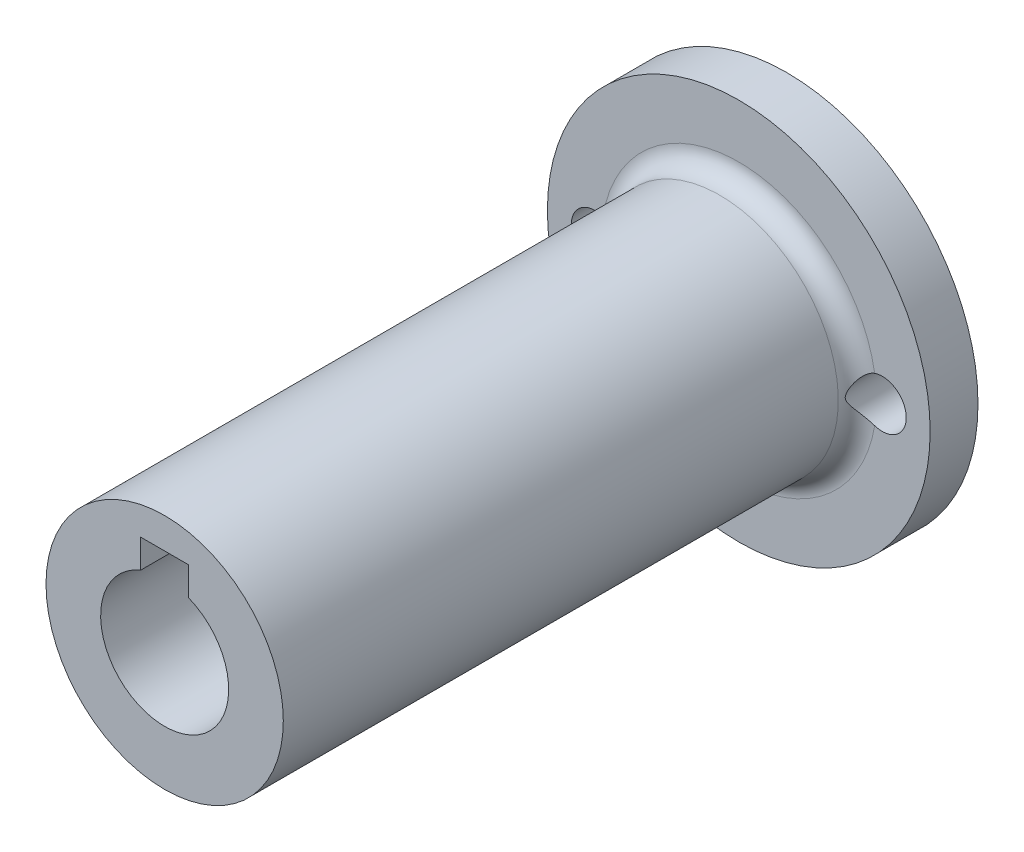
ISO-10303-21;
HEADER;
FILE_DESCRIPTION(('STEP AP214'),'2;1');
FILE_NAME('part.step','',(''),(''),'','','');
FILE_SCHEMA(('AUTOMOTIVE_DESIGN { 1 0 10303 214 1 1 1 1 }'));
ENDSEC;
DATA;
#1=APPLICATION_CONTEXT('core data for automotive mechanical design processes');
#2=APPLICATION_PROTOCOL_DEFINITION('international standard','automotive_design',2000,#1);
#3=PRODUCT_CONTEXT('',#1,'mechanical');
#4=PRODUCT('Part','Part','',(#3));
#5=PRODUCT_RELATED_PRODUCT_CATEGORY('part','',(#4));
#6=PRODUCT_DEFINITION_FORMATION('','',#4);
#7=PRODUCT_DEFINITION_CONTEXT('part definition',#1,'design');
#8=PRODUCT_DEFINITION('design','',#6,#7);
#9=PRODUCT_DEFINITION_SHAPE('','',#8);
#10=(LENGTH_UNIT() NAMED_UNIT(*) SI_UNIT(.MILLI.,.METRE.));
#11=(NAMED_UNIT(*) PLANE_ANGLE_UNIT() SI_UNIT($,.RADIAN.));
#12=(NAMED_UNIT(*) SI_UNIT($,.STERADIAN.) SOLID_ANGLE_UNIT());
#13=UNCERTAINTY_MEASURE_WITH_UNIT(LENGTH_MEASURE(1.E-05),#10,'distance_accuracy_value','');
#14=(GEOMETRIC_REPRESENTATION_CONTEXT(3) GLOBAL_UNCERTAINTY_ASSIGNED_CONTEXT((#13)) GLOBAL_UNIT_ASSIGNED_CONTEXT((#10,
#11,#12)) REPRESENTATION_CONTEXT('',''));
#15=CARTESIAN_POINT('',(0.,0.,0.));
#16=DIRECTION('',(0.,0.,1.));
#17=DIRECTION('',(1.,0.,0.));
#18=AXIS2_PLACEMENT_3D('',#15,#16,#17);
#19=CARTESIAN_POINT('',(0.,0.,0.));
#20=DIRECTION('',(0.,0.,1.));
#21=DIRECTION('',(1.,0.,0.));
#22=AXIS2_PLACEMENT_3D('',#19,#20,#21);
#23=PLANE('',#22);
#24=CARTESIAN_POINT('',(-19.05,0.,0.));
#25=DIRECTION('',(0.,0.,-1.));
#26=DIRECTION('',(-1.,0.,0.));
#27=AXIS2_PLACEMENT_3D('',#24,#25,#26);
#28=CIRCLE('',#27,3.175);
#29=CARTESIAN_POINT('',(-22.225,0.,0.));
#30=VERTEX_POINT('',#29);
#31=EDGE_CURVE('E157',#30,#30,#28,.T.);
#32=ORIENTED_EDGE('',*,*,#31,.F.);
#33=EDGE_LOOP('',(#32));
#34=FACE_BOUND('',#33,.T.);
#35=CARTESIAN_POINT('',(19.05,0.,0.));
#36=DIRECTION('',(0.,0.,-1.));
#37=DIRECTION('',(1.,0.,0.));
#38=AXIS2_PLACEMENT_3D('',#35,#36,#37);
#39=CIRCLE('',#38,3.175);
#40=CARTESIAN_POINT('',(22.225,0.,0.));
#41=VERTEX_POINT('',#40);
#42=EDGE_CURVE('E270',#41,#41,#39,.T.);
#43=ORIENTED_EDGE('',*,*,#42,.F.);
#44=EDGE_LOOP('',(#43));
#45=FACE_BOUND('',#44,.T.);
#46=CARTESIAN_POINT('',(0.,0.,0.));
#47=DIRECTION('',(0.,0.,1.));
#48=DIRECTION('',(1.,0.,0.));
#49=AXIS2_PLACEMENT_3D('',#46,#47,#48);
#50=CIRCLE('',#49,25.4);
#51=CARTESIAN_POINT('',(25.4,0.,0.));
#52=VERTEX_POINT('',#51);
#53=EDGE_CURVE('E215',#52,#52,#50,.T.);
#54=ORIENTED_EDGE('',*,*,#53,.F.);
#55=EDGE_LOOP('',(#54));
#56=FACE_BOUND('',#55,.T.);
#57=DIRECTION('',(0.,1.,0.));
#58=VECTOR('',#57,1.);
#59=CARTESIAN_POINT('',(-3.175,0.,0.));
#60=LINE('',#59,#58);
#61=CARTESIAN_POINT('',(-3.175,7.88076701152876,0.));
#62=VERTEX_POINT('',#61);
#63=CARTESIAN_POINT('',(-3.175,11.6713,0.));
#64=VERTEX_POINT('',#63);
#65=EDGE_CURVE('E230',#62,#64,#60,.T.);
#66=ORIENTED_EDGE('',*,*,#65,.F.);
#67=CARTESIAN_POINT('',(0.,0.,0.));
#68=DIRECTION('',(0.,0.,1.));
#69=DIRECTION('',(1.,0.,0.));
#70=AXIS2_PLACEMENT_3D('',#67,#68,#69);
#71=CIRCLE('',#70,8.4963);
#72=CARTESIAN_POINT('',(3.175,7.88076701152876,0.));
#73=VERTEX_POINT('',#72);
#74=EDGE_CURVE('E259',#62,#73,#71,.T.);
#75=ORIENTED_EDGE('',*,*,#74,.T.);
#76=DIRECTION('',(0.,1.,0.));
#77=VECTOR('',#76,1.);
#78=CARTESIAN_POINT('',(3.175,0.,0.));
#79=LINE('',#78,#77);
#80=CARTESIAN_POINT('',(3.175,11.6713,0.));
#81=VERTEX_POINT('',#80);
#82=EDGE_CURVE('E238',#73,#81,#79,.T.);
#83=ORIENTED_EDGE('',*,*,#82,.T.);
#84=DIRECTION('',(1.,0.,0.));
#85=VECTOR('',#84,1.);
#86=CARTESIAN_POINT('',(0.,11.6713,0.));
#87=LINE('',#86,#85);
#88=EDGE_CURVE('E249',#64,#81,#87,.T.);
#89=ORIENTED_EDGE('',*,*,#88,.F.);
#90=EDGE_LOOP('',(#66,#75,#83,#89));
#91=FACE_BOUND('',#90,.T.);
#92=ADVANCED_FACE('F87',(#34,#45,#56,#91),#23,.F.);
#93=CARTESIAN_POINT('',(0.,0.,82.55));
#94=DIRECTION('',(0.,0.,1.));
#95=DIRECTION('',(1.,0.,0.));
#96=AXIS2_PLACEMENT_3D('',#93,#94,#95);
#97=PLANE('',#96);
#98=CARTESIAN_POINT('',(0.,0.,82.55));
#99=DIRECTION('',(0.,0.,1.));
#100=DIRECTION('',(1.,0.,0.));
#101=AXIS2_PLACEMENT_3D('',#98,#99,#100);
#102=CIRCLE('',#101,15.748);
#103=CARTESIAN_POINT('',(-15.748,0.,82.55));
#104=VERTEX_POINT('',#103);
#105=EDGE_CURVE('E218',#104,#104,#102,.T.);
#106=ORIENTED_EDGE('',*,*,#105,.T.);
#107=EDGE_LOOP('',(#106));
#108=FACE_BOUND('',#107,.T.);
#109=CARTESIAN_POINT('',(0.,0.,82.55));
#110=DIRECTION('',(0.,0.,1.));
#111=DIRECTION('',(1.,0.,0.));
#112=AXIS2_PLACEMENT_3D('',#109,#110,#111);
#113=CIRCLE('',#112,8.4963);
#114=CARTESIAN_POINT('',(-3.175,7.88076701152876,82.55));
#115=VERTEX_POINT('',#114);
#116=CARTESIAN_POINT('',(3.175,7.88076701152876,82.55));
#117=VERTEX_POINT('',#116);
#118=EDGE_CURVE('E233',#115,#117,#113,.T.);
#119=ORIENTED_EDGE('',*,*,#118,.F.);
#120=DIRECTION('',(0.,1.,0.));
#121=VECTOR('',#120,1.);
#122=CARTESIAN_POINT('',(-3.175,0.,82.55));
#123=LINE('',#122,#121);
#124=CARTESIAN_POINT('',(-3.175,11.6713,82.55));
#125=VERTEX_POINT('',#124);
#126=EDGE_CURVE('E234',#115,#125,#123,.T.);
#127=ORIENTED_EDGE('',*,*,#126,.T.);
#128=DIRECTION('',(1.,0.,0.));
#129=VECTOR('',#128,1.);
#130=CARTESIAN_POINT('',(0.,11.6713,82.55));
#131=LINE('',#130,#129);
#132=CARTESIAN_POINT('',(3.175,11.6713,82.55));
#133=VERTEX_POINT('',#132);
#134=EDGE_CURVE('E239',#125,#133,#131,.T.);
#135=ORIENTED_EDGE('',*,*,#134,.T.);
#136=DIRECTION('',(0.,1.,0.));
#137=VECTOR('',#136,1.);
#138=CARTESIAN_POINT('',(3.175,0.,82.55));
#139=LINE('',#138,#137);
#140=EDGE_CURVE('E243',#117,#133,#139,.T.);
#141=ORIENTED_EDGE('',*,*,#140,.F.);
#142=EDGE_LOOP('',(#119,#127,#135,#141));
#143=FACE_BOUND('',#142,.T.);
#144=ADVANCED_FACE('F192',(#108,#143),#97,.T.);
#145=CARTESIAN_POINT('',(0.,0.,6.35));
#146=DIRECTION('',(0.,0.,-1.));
#147=DIRECTION('',(-1.,0.,0.));
#148=AXIS2_PLACEMENT_3D('',#145,#146,#147);
#149=CYLINDRICAL_SURFACE('',#148,25.4);
#150=CARTESIAN_POINT('',(0.,0.,6.35));
#151=DIRECTION('',(0.,0.,1.));
#152=DIRECTION('',(1.,0.,0.));
#153=AXIS2_PLACEMENT_3D('',#150,#151,#152);
#154=CIRCLE('',#153,25.4);
#155=CARTESIAN_POINT('',(25.4,0.,6.35));
#156=VERTEX_POINT('',#155);
#157=EDGE_CURVE('E212',#156,#156,#154,.T.);
#158=ORIENTED_EDGE('',*,*,#157,.F.);
#159=EDGE_LOOP('',(#158));
#160=FACE_BOUND('',#159,.T.);
#161=ORIENTED_EDGE('',*,*,#53,.T.);
#162=EDGE_LOOP('',(#161));
#163=FACE_BOUND('',#162,.T.);
#164=ADVANCED_FACE('F195',(#160,#163),#149,.T.);
#165=CARTESIAN_POINT('',(0.,0.,6.35));
#166=DIRECTION('',(0.,0.,1.));
#167=DIRECTION('',(1.,0.,0.));
#168=AXIS2_PLACEMENT_3D('',#165,#166,#167);
#169=PLANE('',#168);
#170=CARTESIAN_POINT('',(-19.05,0.,6.34999999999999));
#171=DIRECTION('',(0.,0.,1.));
#172=DIRECTION('',(1.,0.,0.));
#173=AXIS2_PLACEMENT_3D('',#170,#171,#172);
#174=CIRCLE('',#173,3.175);
#175=CARTESIAN_POINT('',(-18.0386566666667,3.00961952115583,6.34999999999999));
#176=VERTEX_POINT('',#175);
#177=CARTESIAN_POINT('',(-18.0386566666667,-3.00961952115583,6.35));
#178=VERTEX_POINT('',#177);
#179=EDGE_CURVE('E115',#176,#178,#174,.T.);
#180=ORIENTED_EDGE('',*,*,#179,.F.);
#181=CARTESIAN_POINT('',(0.,0.,6.35));
#182=DIRECTION('',(0.,0.,1.));
#183=DIRECTION('',(1.,0.,0.));
#184=AXIS2_PLACEMENT_3D('',#181,#182,#183);
#185=CIRCLE('',#184,18.288);
#186=CARTESIAN_POINT('',(18.0386566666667,3.00961952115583,6.35));
#187=VERTEX_POINT('',#186);
#188=EDGE_CURVE('E155',#176,#187,#185,.F.);
#189=ORIENTED_EDGE('',*,*,#188,.T.);
#190=CARTESIAN_POINT('',(19.05,0.,6.34999999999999));
#191=DIRECTION('',(0.,0.,1.));
#192=DIRECTION('',(1.,0.,0.));
#193=AXIS2_PLACEMENT_3D('',#190,#191,#192);
#194=CIRCLE('',#193,3.175);
#195=CARTESIAN_POINT('',(18.0386566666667,-3.00961952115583,6.34999999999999));
#196=VERTEX_POINT('',#195);
#197=EDGE_CURVE('E108',#196,#187,#194,.T.);
#198=ORIENTED_EDGE('',*,*,#197,.F.);
#199=EDGE_CURVE('E150',#196,#178,#185,.F.);
#200=ORIENTED_EDGE('',*,*,#199,.T.);
#201=EDGE_LOOP('',(#180,#189,#198,#200));
#202=FACE_BOUND('',#201,.T.);
#203=ORIENTED_EDGE('',*,*,#157,.T.);
#204=EDGE_LOOP('',(#203));
#205=FACE_BOUND('',#204,.T.);
#206=ADVANCED_FACE('F153',(#202,#205),#169,.T.);
#207=CARTESIAN_POINT('',(0.,0.,82.55));
#208=DIRECTION('',(0.,0.,-1.));
#209=DIRECTION('',(-1.,0.,0.));
#210=AXIS2_PLACEMENT_3D('',#207,#208,#209);
#211=CYLINDRICAL_SURFACE('',#210,15.748);
#212=CARTESIAN_POINT('',(0.,0.,8.89));
#213=DIRECTION('',(0.,0.,1.));
#214=DIRECTION('',(1.,0.,0.));
#215=AXIS2_PLACEMENT_3D('',#212,#213,#214);
#216=CIRCLE('',#215,15.748);
#217=CARTESIAN_POINT('',(-15.748,0.,8.88999999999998));
#218=VERTEX_POINT('',#217);
#219=EDGE_CURVE('E163',#218,#218,#216,.T.);
#220=CARTESIAN_POINT('',(-15.748,0.,8.88999999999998));
#221=CARTESIAN_POINT('',(-15.748,0.,9.65729166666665));
#222=CARTESIAN_POINT('',(-15.748,0.,10.4245833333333));
#223=CARTESIAN_POINT('',(-15.748,0.,11.9591666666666));
#224=CARTESIAN_POINT('',(-15.748,0.,12.7264583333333));
#225=CARTESIAN_POINT('',(-15.748,0.,14.2610416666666));
#226=CARTESIAN_POINT('',(-15.748,0.,15.0283333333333));
#227=CARTESIAN_POINT('',(-15.748,0.,16.5629166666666));
#228=CARTESIAN_POINT('',(-15.748,0.,17.3302083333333));
#229=CARTESIAN_POINT('',(-15.748,0.,18.8647916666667));
#230=CARTESIAN_POINT('',(-15.748,0.,19.6320833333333));
#231=CARTESIAN_POINT('',(-15.748,0.,21.1666666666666));
#232=CARTESIAN_POINT('',(-15.748,0.,21.9339583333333));
#233=CARTESIAN_POINT('',(-15.748,0.,23.4685416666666));
#234=CARTESIAN_POINT('',(-15.748,0.,24.2358333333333));
#235=CARTESIAN_POINT('',(-15.748,0.,25.7704166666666));
#236=CARTESIAN_POINT('',(-15.748,0.,26.5377083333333));
#237=CARTESIAN_POINT('',(-15.748,0.,28.0722916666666));
#238=CARTESIAN_POINT('',(-15.748,0.,28.8395833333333));
#239=CARTESIAN_POINT('',(-15.748,0.,30.3741666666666));
#240=CARTESIAN_POINT('',(-15.748,0.,31.1414583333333));
#241=CARTESIAN_POINT('',(-15.748,0.,32.6760416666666));
#242=CARTESIAN_POINT('',(-15.748,0.,33.4433333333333));
#243=CARTESIAN_POINT('',(-15.748,0.,34.9779166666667));
#244=CARTESIAN_POINT('',(-15.748,0.,35.7452083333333));
#245=CARTESIAN_POINT('',(-15.748,0.,37.2797916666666));
#246=CARTESIAN_POINT('',(-15.748,0.,38.0470833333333));
#247=CARTESIAN_POINT('',(-15.748,0.,39.5816666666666));
#248=CARTESIAN_POINT('',(-15.748,0.,40.3489583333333));
#249=CARTESIAN_POINT('',(-15.748,0.,41.8835416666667));
#250=CARTESIAN_POINT('',(-15.748,0.,42.6508333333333));
#251=CARTESIAN_POINT('',(-15.748,0.,44.1854166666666));
#252=CARTESIAN_POINT('',(-15.748,0.,44.9527083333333));
#253=CARTESIAN_POINT('',(-15.748,0.,46.4872916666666));
#254=CARTESIAN_POINT('',(-15.748,0.,47.2545833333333));
#255=CARTESIAN_POINT('',(-15.748,0.,48.7891666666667));
#256=CARTESIAN_POINT('',(-15.748,0.,49.5564583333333));
#257=CARTESIAN_POINT('',(-15.748,0.,51.0910416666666));
#258=CARTESIAN_POINT('',(-15.748,0.,51.8583333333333));
#259=CARTESIAN_POINT('',(-15.748,0.,53.3929166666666));
#260=CARTESIAN_POINT('',(-15.748,0.,54.1602083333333));
#261=CARTESIAN_POINT('',(-15.748,0.,55.6947916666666));
#262=CARTESIAN_POINT('',(-15.748,0.,56.4620833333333));
#263=CARTESIAN_POINT('',(-15.748,0.,57.9966666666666));
#264=CARTESIAN_POINT('',(-15.748,0.,58.7639583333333));
#265=CARTESIAN_POINT('',(-15.748,0.,60.2985416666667));
#266=CARTESIAN_POINT('',(-15.748,0.,61.0658333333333));
#267=CARTESIAN_POINT('',(-15.748,0.,62.6004166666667));
#268=CARTESIAN_POINT('',(-15.748,0.,63.3677083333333));
#269=CARTESIAN_POINT('',(-15.748,0.,64.9022916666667));
#270=CARTESIAN_POINT('',(-15.748,0.,65.6695833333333));
#271=CARTESIAN_POINT('',(-15.748,0.,67.2041666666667));
#272=CARTESIAN_POINT('',(-15.748,0.,67.9714583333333));
#273=CARTESIAN_POINT('',(-15.748,0.,69.5060416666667));
#274=CARTESIAN_POINT('',(-15.748,0.,70.2733333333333));
#275=CARTESIAN_POINT('',(-15.748,0.,71.8079166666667));
#276=CARTESIAN_POINT('',(-15.748,0.,72.5752083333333));
#277=CARTESIAN_POINT('',(-15.748,0.,74.1097916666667));
#278=CARTESIAN_POINT('',(-15.748,0.,74.8770833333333));
#279=CARTESIAN_POINT('',(-15.748,0.,76.4116666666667));
#280=CARTESIAN_POINT('',(-15.748,0.,77.1789583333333));
#281=CARTESIAN_POINT('',(-15.748,0.,78.7135416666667));
#282=CARTESIAN_POINT('',(-15.748,0.,79.4808333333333));
#283=CARTESIAN_POINT('',(-15.748,0.,81.0154166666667));
#284=CARTESIAN_POINT('',(-15.748,0.,81.7827083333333));
#285=CARTESIAN_POINT('',(-15.748,0.,82.55));
#286=B_SPLINE_CURVE_WITH_KNOTS('',3,(#220,#221,#222,#223,#224,#225,#226,#227,#228,#229,#230,
#231,#232,#233,#234,#235,#236,#237,#238,#239,#240,#241,#242,#243,#244,#245,#246,#247,#248,#249,
#250,#251,#252,#253,#254,#255,#256,#257,#258,#259,#260,#261,#262,#263,#264,#265,#266,#267,#268,
#269,#270,#271,#272,#273,#274,#275,#276,#277,#278,#279,#280,#281,#282,#283,#284,#285),
.UNSPECIFIED.,.F.,.F.,(4,2,2,2,2,2,2,2,2,2,2,2,2,2,2,2,2,2,2,2,2,2,2,2,2,2,2,2,2,2,2,2,4),(0.,
2.301875,4.60375,6.905625,9.20750000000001,11.509375,13.81125,16.113125,18.415,20.716875,
23.01875,25.320625,27.6225,29.924375,32.22625,34.528125,36.83,39.131875,41.43375,43.735625,
46.0375,48.339375,50.64125,52.943125,55.245,57.546875,59.84875,62.150625,64.4525,66.754375,
69.05625,71.358125,73.66),.UNSPECIFIED.);
#287=EDGE_CURVE('BSEAM197',#218,#104,#286,.T.);
#288=ORIENTED_EDGE('',*,*,#219,.T.);
#289=ORIENTED_EDGE('',*,*,#105,.F.);
#290=ORIENTED_EDGE('',*,*,#287,.T.);
#291=ORIENTED_EDGE('',*,*,#287,.F.);
#292=EDGE_LOOP('',(#288,#290,#289,#291));
#293=FACE_BOUND('',#292,.T.);
#294=ADVANCED_FACE('F197',(#293),#211,.T.);
#295=CARTESIAN_POINT('',(0.,0.,8.89));
#296=DIRECTION('',(0.,0.,1.));
#297=DIRECTION('',(1.,0.,0.));
#298=AXIS2_PLACEMENT_3D('',#295,#296,#297);
#299=TOROIDAL_SURFACE('',#298,18.288,2.54);
#300=ORIENTED_EDGE('',*,*,#188,.F.);
#301=CARTESIAN_POINT('',(-18.2882,3.08225335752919,6.36314931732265));
#302=CARTESIAN_POINT('',(-18.2283304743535,3.06747186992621,6.35685287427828));
#303=CARTESIAN_POINT('',(-18.1686833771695,3.05086379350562,6.35284534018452));
#304=CARTESIAN_POINT('',(-18.0503812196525,3.01416564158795,6.3492924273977));
#305=CARTESIAN_POINT('',(-17.9917254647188,2.99407812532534,6.34974378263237));
#306=CARTESIAN_POINT('',(-17.8763568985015,2.95075524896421,6.35496181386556));
#307=CARTESIAN_POINT('',(-17.8196318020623,2.9275481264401,6.35969174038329));
#308=CARTESIAN_POINT('',(-17.7080266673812,2.87810076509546,6.37319582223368));
#309=CARTESIAN_POINT('',(-17.6531468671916,2.85186013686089,6.38197049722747));
#310=CARTESIAN_POINT('',(-17.4920941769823,2.76912445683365,6.41392676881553));
#311=CARTESIAN_POINT('',(-17.3891082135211,2.70846388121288,6.44276182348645));
#312=CARTESIAN_POINT('',(-17.1934734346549,2.57833746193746,6.51302090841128));
#313=CARTESIAN_POINT('',(-17.1008461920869,2.50885386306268,6.55447056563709));
#314=CARTESIAN_POINT('',(-16.8855989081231,2.32891374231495,6.66921579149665));
#315=CARTESIAN_POINT('',(-16.7693175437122,2.21453776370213,6.74832595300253));
#316=CARTESIAN_POINT('',(-16.6122174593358,2.03572917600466,6.87764223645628));
#317=CARTESIAN_POINT('',(-16.5626537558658,1.97478598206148,6.92262643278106));
#318=CARTESIAN_POINT('',(-16.4690748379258,1.85080220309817,7.01538268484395));
#319=CARTESIAN_POINT('',(-16.4250579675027,1.78776225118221,7.0631539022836));
#320=CARTESIAN_POINT('',(-16.3256791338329,1.63405576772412,7.18038634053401));
#321=CARTESIAN_POINT('',(-16.2728845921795,1.54248510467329,7.25083659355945));
#322=CARTESIAN_POINT('',(-16.1770319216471,1.35562749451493,7.3937221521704));
#323=CARTESIAN_POINT('',(-16.1339909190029,1.26033434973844,7.46616070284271));
#324=CARTESIAN_POINT('',(-16.0572660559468,1.06544634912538,7.61028255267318));
#325=CARTESIAN_POINT('',(-16.0235816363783,0.965851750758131,7.68196589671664));
#326=CARTESIAN_POINT('',(-15.9800592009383,0.811733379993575,7.78509513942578));
#327=CARTESIAN_POINT('',(-15.9667316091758,0.759642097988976,7.81869896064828));
#328=CARTESIAN_POINT('',(-15.9424676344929,0.653328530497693,7.88326324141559));
#329=CARTESIAN_POINT('',(-15.9315299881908,0.599107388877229,7.91422509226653));
#330=CARTESIAN_POINT('',(-15.9093983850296,0.471782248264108,7.98012082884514));
#331=CARTESIAN_POINT('',(-15.8990426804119,0.397747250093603,8.01361941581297));
#332=CARTESIAN_POINT('',(-15.8835424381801,0.244727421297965,8.06585799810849));
#333=CARTESIAN_POINT('',(-15.8783233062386,0.165831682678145,8.08480834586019));
#334=CARTESIAN_POINT('',(-15.8746749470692,0.0308898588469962,8.09805472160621));
#335=CARTESIAN_POINT('',(-15.8746213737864,-0.0244992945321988,8.09824883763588));
#336=CARTESIAN_POINT('',(-15.8773677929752,-0.134430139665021,8.0882779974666));
#337=CARTESIAN_POINT('',(-15.8801803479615,-0.188967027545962,8.07806743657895));
#338=CARTESIAN_POINT('',(-15.8901412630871,-0.319215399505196,8.04336652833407));
#339=CARTESIAN_POINT('',(-15.8986587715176,-0.393599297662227,8.01455306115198));
#340=CARTESIAN_POINT('',(-15.9199992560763,-0.537659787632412,7.94788010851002));
#341=CARTESIAN_POINT('',(-15.9328464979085,-0.607307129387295,7.90996999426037));
#342=CARTESIAN_POINT('',(-15.9586193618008,-0.725707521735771,7.83982436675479));
#343=CARTESIAN_POINT('',(-15.9706915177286,-0.775264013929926,7.80860299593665));
#344=CARTESIAN_POINT('',(-15.9969084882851,-0.87281678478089,7.74461767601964));
#345=CARTESIAN_POINT('',(-16.0110539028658,-0.9208126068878,7.71185328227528));
#346=CARTESIAN_POINT('',(-16.0566055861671,-1.06309239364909,7.61224984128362));
#347=CARTESIAN_POINT('',(-16.0910984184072,-1.1555386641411,7.54418282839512));
#348=CARTESIAN_POINT('',(-16.1684907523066,-1.33687008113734,7.40814814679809));
#349=CARTESIAN_POINT('',(-16.2113888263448,-1.42575582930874,7.34018046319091));
#350=CARTESIAN_POINT('',(-16.3059946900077,-1.60028006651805,7.20644120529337));
#351=CARTESIAN_POINT('',(-16.3576934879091,-1.68592176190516,7.14066747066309));
#352=CARTESIAN_POINT('',(-16.4948501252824,-1.89019678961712,6.98539970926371));
#353=CARTESIAN_POINT('',(-16.5852496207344,-2.00712224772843,6.8979152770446));
#354=CARTESIAN_POINT('',(-16.786818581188,-2.23188250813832,6.73629535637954));
#355=CARTESIAN_POINT('',(-16.8979448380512,-2.33973555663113,6.6621327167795));
#356=CARTESIAN_POINT('',(-17.1131623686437,-2.51874255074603,6.54831294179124));
#357=CARTESIAN_POINT('',(-17.2128664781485,-2.59259415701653,6.50464223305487));
#358=CARTESIAN_POINT('',(-17.4240162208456,-2.72993522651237,6.43204564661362));
#359=CARTESIAN_POINT('',(-17.5354325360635,-2.79344959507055,6.40308396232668));
#360=CARTESIAN_POINT('',(-17.7016469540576,-2.87501612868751,6.37425958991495));
#361=CARTESIAN_POINT('',(-17.7526916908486,-2.8984121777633,6.36721061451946));
#362=CARTESIAN_POINT('',(-17.8562636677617,-2.94258059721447,6.35659009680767));
#363=CARTESIAN_POINT('',(-17.90879062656,-2.96335346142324,6.35301789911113));
#364=CARTESIAN_POINT('',(-18.0153603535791,-3.00222959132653,6.34949904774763));
#365=CARTESIAN_POINT('',(-18.0694111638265,-3.02031313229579,6.34957797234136));
#366=CARTESIAN_POINT('',(-18.178312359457,-3.05353012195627,6.35350938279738));
#367=CARTESIAN_POINT('',(-18.2331632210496,-3.0686617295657,6.35736421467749));
#368=CARTESIAN_POINT('',(-18.2882,-3.08225335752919,6.36314931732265));
#369=B_SPLINE_CURVE_WITH_KNOTS('',3,(#301,#302,#303,#304,#305,#306,#307,#308,#309,#310,#311,
#312,#313,#314,#315,#316,#317,#318,#319,#320,#321,#322,#323,#324,#325,#326,#327,#328,#329,#330,
#331,#332,#333,#334,#335,#336,#337,#338,#339,#340,#341,#342,#343,#344,#345,#346,#347,#348,#349,
#350,#351,#352,#353,#354,#355,#356,#357,#358,#359,#360,#361,#362,#363,#364,#365,#366,#367,#368),
.UNSPECIFIED.,.F.,.F.,(4,2,2,2,2,2,2,2,2,2,2,2,2,2,2,2,2,2,2,2,2,2,2,2,2,2,2,2,2,2,2,2,2,4),(0.,
0.185877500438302,0.371618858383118,0.55577984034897,0.739964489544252,1.10706617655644,
1.47491867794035,2.01549374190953,2.28690034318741,2.55822572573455,2.93879125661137,
3.32001993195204,3.70122581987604,3.89134569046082,4.08136481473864,4.32626194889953,
4.56754771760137,4.7325942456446,4.89836731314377,5.13760911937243,5.37821467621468,
5.55753526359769,5.73690784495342,6.09612103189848,6.45527325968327,6.81406071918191,
7.32764695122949,7.84017426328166,8.23335853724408,8.62558102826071,8.79520669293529,
8.96480037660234,9.13558234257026,9.30647048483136),.UNSPECIFIED.);
#370=EDGE_CURVE('E12',#176,#178,#369,.T.);
#371=ORIENTED_EDGE('',*,*,#370,.T.);
#372=ORIENTED_EDGE('',*,*,#199,.F.);
#373=CARTESIAN_POINT('',(18.2882,-3.08225335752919,6.36314931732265));
#374=CARTESIAN_POINT('',(18.2283304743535,-3.06747186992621,6.35685287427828));
#375=CARTESIAN_POINT('',(18.1686833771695,-3.05086379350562,6.35284534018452));
#376=CARTESIAN_POINT('',(18.0503812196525,-3.01416564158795,6.3492924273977));
#377=CARTESIAN_POINT('',(17.9917254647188,-2.99407812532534,6.34974378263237));
#378=CARTESIAN_POINT('',(17.8763568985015,-2.95075524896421,6.35496181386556));
#379=CARTESIAN_POINT('',(17.8196318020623,-2.9275481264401,6.35969174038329));
#380=CARTESIAN_POINT('',(17.7080266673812,-2.87810076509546,6.37319582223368));
#381=CARTESIAN_POINT('',(17.6531468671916,-2.85186013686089,6.38197049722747));
#382=CARTESIAN_POINT('',(17.4920941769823,-2.76912445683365,6.41392676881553));
#383=CARTESIAN_POINT('',(17.3891082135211,-2.70846388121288,6.44276182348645));
#384=CARTESIAN_POINT('',(17.1934734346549,-2.57833746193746,6.51302090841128));
#385=CARTESIAN_POINT('',(17.1008461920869,-2.50885386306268,6.55447056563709));
#386=CARTESIAN_POINT('',(16.8855989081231,-2.32891374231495,6.66921579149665));
#387=CARTESIAN_POINT('',(16.7693175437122,-2.21453776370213,6.74832595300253));
#388=CARTESIAN_POINT('',(16.6122174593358,-2.03572917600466,6.87764223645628));
#389=CARTESIAN_POINT('',(16.5626537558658,-1.97478598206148,6.92262643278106));
#390=CARTESIAN_POINT('',(16.4690748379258,-1.85080220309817,7.01538268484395));
#391=CARTESIAN_POINT('',(16.4250579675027,-1.78776225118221,7.0631539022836));
#392=CARTESIAN_POINT('',(16.3256791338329,-1.63405576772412,7.18038634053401));
#393=CARTESIAN_POINT('',(16.2728845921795,-1.54248510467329,7.25083659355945));
#394=CARTESIAN_POINT('',(16.1770319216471,-1.35562749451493,7.3937221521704));
#395=CARTESIAN_POINT('',(16.1339909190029,-1.26033434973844,7.46616070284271));
#396=CARTESIAN_POINT('',(16.0572660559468,-1.06544634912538,7.61028255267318));
#397=CARTESIAN_POINT('',(16.0235816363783,-0.965851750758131,7.68196589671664));
#398=CARTESIAN_POINT('',(15.9800592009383,-0.811733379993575,7.78509513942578));
#399=CARTESIAN_POINT('',(15.9667316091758,-0.759642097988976,7.81869896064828));
#400=CARTESIAN_POINT('',(15.9424676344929,-0.653328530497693,7.88326324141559));
#401=CARTESIAN_POINT('',(15.9315299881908,-0.599107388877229,7.91422509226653));
#402=CARTESIAN_POINT('',(15.9093983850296,-0.471782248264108,7.98012082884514));
#403=CARTESIAN_POINT('',(15.8990426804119,-0.397747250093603,8.01361941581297));
#404=CARTESIAN_POINT('',(15.8835424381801,-0.244727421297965,8.06585799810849));
#405=CARTESIAN_POINT('',(15.8783233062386,-0.165831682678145,8.08480834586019));
#406=CARTESIAN_POINT('',(15.8746749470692,-0.0308898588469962,8.09805472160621));
#407=CARTESIAN_POINT('',(15.8746213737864,0.0244992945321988,8.09824883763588));
#408=CARTESIAN_POINT('',(15.8773677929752,0.134430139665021,8.0882779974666));
#409=CARTESIAN_POINT('',(15.8801803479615,0.188967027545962,8.07806743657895));
#410=CARTESIAN_POINT('',(15.8901412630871,0.319215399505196,8.04336652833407));
#411=CARTESIAN_POINT('',(15.8986587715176,0.393599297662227,8.01455306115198));
#412=CARTESIAN_POINT('',(15.9199992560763,0.537659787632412,7.94788010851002));
#413=CARTESIAN_POINT('',(15.9328464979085,0.607307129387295,7.90996999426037));
#414=CARTESIAN_POINT('',(15.9586193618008,0.725707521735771,7.83982436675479));
#415=CARTESIAN_POINT('',(15.9706915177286,0.775264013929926,7.80860299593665));
#416=CARTESIAN_POINT('',(15.9969084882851,0.87281678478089,7.74461767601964));
#417=CARTESIAN_POINT('',(16.0110539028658,0.9208126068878,7.71185328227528));
#418=CARTESIAN_POINT('',(16.0566055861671,1.06309239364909,7.61224984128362));
#419=CARTESIAN_POINT('',(16.0910984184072,1.1555386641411,7.54418282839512));
#420=CARTESIAN_POINT('',(16.1684907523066,1.33687008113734,7.40814814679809));
#421=CARTESIAN_POINT('',(16.2113888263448,1.42575582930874,7.34018046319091));
#422=CARTESIAN_POINT('',(16.3059946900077,1.60028006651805,7.20644120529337));
#423=CARTESIAN_POINT('',(16.3576934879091,1.68592176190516,7.14066747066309));
#424=CARTESIAN_POINT('',(16.4948501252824,1.89019678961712,6.98539970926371));
#425=CARTESIAN_POINT('',(16.5852496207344,2.00712224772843,6.8979152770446));
#426=CARTESIAN_POINT('',(16.786818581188,2.23188250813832,6.73629535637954));
#427=CARTESIAN_POINT('',(16.8979448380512,2.33973555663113,6.6621327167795));
#428=CARTESIAN_POINT('',(17.1131623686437,2.51874255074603,6.54831294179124));
#429=CARTESIAN_POINT('',(17.2128664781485,2.59259415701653,6.50464223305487));
#430=CARTESIAN_POINT('',(17.4240162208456,2.72993522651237,6.43204564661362));
#431=CARTESIAN_POINT('',(17.5354325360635,2.79344959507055,6.40308396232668));
#432=CARTESIAN_POINT('',(17.7016469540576,2.87501612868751,6.37425958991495));
#433=CARTESIAN_POINT('',(17.7526916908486,2.8984121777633,6.36721061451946));
#434=CARTESIAN_POINT('',(17.8562636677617,2.94258059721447,6.35659009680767));
#435=CARTESIAN_POINT('',(17.90879062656,2.96335346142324,6.35301789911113));
#436=CARTESIAN_POINT('',(18.0153603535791,3.00222959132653,6.34949904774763));
#437=CARTESIAN_POINT('',(18.0694111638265,3.02031313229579,6.34957797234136));
#438=CARTESIAN_POINT('',(18.178312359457,3.05353012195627,6.35350938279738));
#439=CARTESIAN_POINT('',(18.2331632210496,3.0686617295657,6.35736421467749));
#440=CARTESIAN_POINT('',(18.2882,3.08225335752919,6.36314931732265));
#441=B_SPLINE_CURVE_WITH_KNOTS('',3,(#373,#374,#375,#376,#377,#378,#379,#380,#381,#382,#383,
#384,#385,#386,#387,#388,#389,#390,#391,#392,#393,#394,#395,#396,#397,#398,#399,#400,#401,#402,
#403,#404,#405,#406,#407,#408,#409,#410,#411,#412,#413,#414,#415,#416,#417,#418,#419,#420,#421,
#422,#423,#424,#425,#426,#427,#428,#429,#430,#431,#432,#433,#434,#435,#436,#437,#438,#439,#440),
.UNSPECIFIED.,.F.,.F.,(4,2,2,2,2,2,2,2,2,2,2,2,2,2,2,2,2,2,2,2,2,2,2,2,2,2,2,2,2,2,2,2,2,4),(0.,
0.185877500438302,0.371618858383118,0.55577984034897,0.739964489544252,1.10706617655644,
1.47491867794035,2.01549374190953,2.28690034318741,2.55822572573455,2.93879125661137,
3.32001993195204,3.70122581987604,3.89134569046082,4.08136481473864,4.32626194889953,
4.56754771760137,4.7325942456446,4.89836731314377,5.13760911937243,5.37821467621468,
5.55753526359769,5.73690784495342,6.09612103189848,6.45527325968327,6.81406071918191,
7.32764695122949,7.84017426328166,8.23335853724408,8.62558102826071,8.79520669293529,
8.96480037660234,9.13558234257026,9.30647048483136),.UNSPECIFIED.);
#442=EDGE_CURVE('E102',#196,#187,#441,.T.);
#443=ORIENTED_EDGE('',*,*,#442,.T.);
#444=EDGE_LOOP('',(#300,#371,#372,#443));
#445=FACE_BOUND('',#444,.T.);
#446=ORIENTED_EDGE('',*,*,#219,.F.);
#447=EDGE_LOOP('',(#446));
#448=FACE_BOUND('',#447,.T.);
#449=ADVANCED_FACE('F89',(#445,#448),#299,.F.);
#450=CARTESIAN_POINT('',(0.,0.,0.));
#451=DIRECTION('',(0.,0.,1.));
#452=DIRECTION('',(1.,0.,0.));
#453=AXIS2_PLACEMENT_3D('',#450,#451,#452);
#454=CYLINDRICAL_SURFACE('',#453,8.4963);
#455=ORIENTED_EDGE('',*,*,#118,.T.);
#456=DIRECTION('',(0.,0.,1.));
#457=VECTOR('',#456,1.);
#458=CARTESIAN_POINT('',(3.175,7.88076701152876,0.));
#459=LINE('',#458,#457);
#460=EDGE_CURVE('E223',#73,#117,#459,.T.);
#461=ORIENTED_EDGE('',*,*,#460,.F.);
#462=ORIENTED_EDGE('',*,*,#74,.F.);
#463=DIRECTION('',(0.,0.,1.));
#464=VECTOR('',#463,1.);
#465=CARTESIAN_POINT('',(-3.175,7.88076701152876,0.));
#466=LINE('',#465,#464);
#467=EDGE_CURVE('E256',#62,#115,#466,.T.);
#468=ORIENTED_EDGE('',*,*,#467,.T.);
#469=EDGE_LOOP('',(#455,#461,#462,#468));
#470=FACE_BOUND('',#469,.T.);
#471=ADVANCED_FACE('F176',(#470),#454,.F.);
#472=CARTESIAN_POINT('',(0.,11.6713,0.));
#473=DIRECTION('',(0.,-1.,0.));
#474=DIRECTION('',(0.,0.,-1.));
#475=AXIS2_PLACEMENT_3D('',#472,#473,#474);
#476=PLANE('',#475);
#477=ORIENTED_EDGE('',*,*,#134,.F.);
#478=DIRECTION('',(0.,0.,1.));
#479=VECTOR('',#478,1.);
#480=CARTESIAN_POINT('',(-3.175,11.6713,0.));
#481=LINE('',#480,#479);
#482=EDGE_CURVE('E229',#64,#125,#481,.T.);
#483=ORIENTED_EDGE('',*,*,#482,.F.);
#484=ORIENTED_EDGE('',*,*,#88,.T.);
#485=DIRECTION('',(0.,0.,1.));
#486=VECTOR('',#485,1.);
#487=CARTESIAN_POINT('',(3.175,11.6713,0.));
#488=LINE('',#487,#486);
#489=EDGE_CURVE('E226',#81,#133,#488,.T.);
#490=ORIENTED_EDGE('',*,*,#489,.T.);
#491=EDGE_LOOP('',(#477,#483,#484,#490));
#492=FACE_BOUND('',#491,.T.);
#493=ADVANCED_FACE('F180',(#492),#476,.T.);
#494=CARTESIAN_POINT('',(-3.175,0.,0.));
#495=DIRECTION('',(1.,0.,0.));
#496=DIRECTION('',(0.,0.,-1.));
#497=AXIS2_PLACEMENT_3D('',#494,#495,#496);
#498=PLANE('',#497);
#499=ORIENTED_EDGE('',*,*,#126,.F.);
#500=ORIENTED_EDGE('',*,*,#467,.F.);
#501=ORIENTED_EDGE('',*,*,#65,.T.);
#502=ORIENTED_EDGE('',*,*,#482,.T.);
#503=EDGE_LOOP('',(#499,#500,#501,#502));
#504=FACE_BOUND('',#503,.T.);
#505=ADVANCED_FACE('F182',(#504),#498,.T.);
#506=CARTESIAN_POINT('',(3.175,0.,0.));
#507=DIRECTION('',(1.,0.,0.));
#508=DIRECTION('',(0.,0.,-1.));
#509=AXIS2_PLACEMENT_3D('',#506,#507,#508);
#510=PLANE('',#509);
#511=ORIENTED_EDGE('',*,*,#140,.T.);
#512=ORIENTED_EDGE('',*,*,#489,.F.);
#513=ORIENTED_EDGE('',*,*,#82,.F.);
#514=ORIENTED_EDGE('',*,*,#460,.T.);
#515=EDGE_LOOP('',(#511,#512,#513,#514));
#516=FACE_BOUND('',#515,.T.);
#517=ADVANCED_FACE('F175',(#516),#510,.F.);
#518=CARTESIAN_POINT('',(19.05,0.,82.55));
#519=DIRECTION('',(0.,0.,-1.));
#520=DIRECTION('',(-1.,0.,0.));
#521=AXIS2_PLACEMENT_3D('',#518,#519,#520);
#522=CYLINDRICAL_SURFACE('',#521,3.175);
#523=ORIENTED_EDGE('',*,*,#197,.T.);
#524=ORIENTED_EDGE('',*,*,#442,.F.);
#525=EDGE_LOOP('',(#523,#524));
#526=FACE_BOUND('',#525,.T.);
#527=ORIENTED_EDGE('',*,*,#42,.T.);
#528=EDGE_LOOP('',(#527));
#529=FACE_BOUND('',#528,.T.);
#530=ADVANCED_FACE('F143',(#526,#529),#522,.F.);
#531=CARTESIAN_POINT('',(-19.05,0.,82.55));
#532=DIRECTION('',(0.,0.,-1.));
#533=DIRECTION('',(-1.,0.,0.));
#534=AXIS2_PLACEMENT_3D('',#531,#532,#533);
#535=CYLINDRICAL_SURFACE('',#534,3.175);
#536=ORIENTED_EDGE('',*,*,#179,.T.);
#537=ORIENTED_EDGE('',*,*,#370,.F.);
#538=EDGE_LOOP('',(#536,#537));
#539=FACE_BOUND('',#538,.T.);
#540=ORIENTED_EDGE('',*,*,#31,.T.);
#541=EDGE_LOOP('',(#540));
#542=FACE_BOUND('',#541,.T.);
#543=ADVANCED_FACE('F174',(#539,#542),#535,.F.);
#544=CLOSED_SHELL('',(#92,#144,#164,#206,#294,#449,#471,#493,#505,#517,#530,#543));
#545=MANIFOLD_SOLID_BREP('B2',#544);
#546=ADVANCED_BREP_SHAPE_REPRESENTATION('',(#18,#545),#14);
#547=SHAPE_DEFINITION_REPRESENTATION(#9,#546);
ENDSEC;
END-ISO-10303-21;
